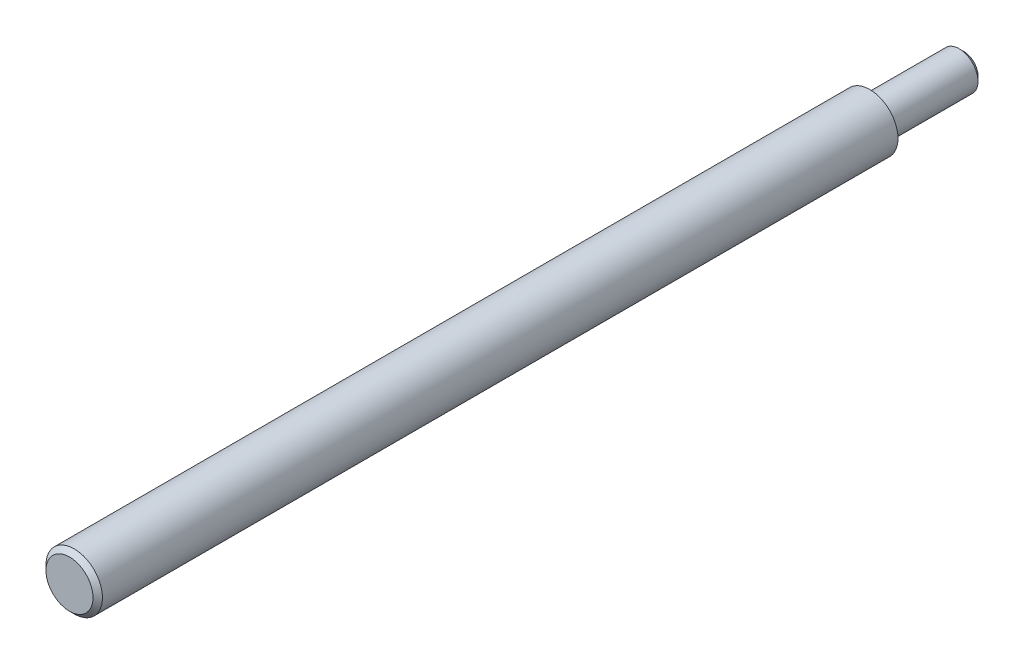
from build123d import *

# Parameters (mm, degrees)
SKETCH_1_R      = 6
EXTRUDE_1_DEPTH = 170
SKETCH_2_R      = 4
EXTRUDE_2_DEPTH = 20
CHAMFER_1_SIZE  = 1
CHAMFER_2_SIZE  = 1


with BuildPart() as part:
    # Sketch 1 → Extrude 1 (new body)
    with BuildSketch(Plane.XY):
        Circle(SKETCH_1_R)
    extrude(amount=EXTRUDE_1_DEPTH)

    # Sketch 2 → Extrude 2 (add)
    with BuildSketch(Plane(origin=(0, 0, 0), x_dir=(-1, 0, 0), z_dir=(0, 0, -1))):
        with Locations(Location((0, 0, 0), (0, 0, 180))):
            Circle(SKETCH_2_R)
    extrude(amount=EXTRUDE_2_DEPTH)

    # Chamfer 1
    chamfer_1_edges = [part.edges().sort_by_distance(p)[0] for p in [
        (-6, 0, 170),
    ]]
    chamfer(chamfer_1_edges, length=CHAMFER_1_SIZE)

    # Chamfer 2
    chamfer_2_edges = [part.edges().sort_by_distance(p)[0] for p in [
        (-4, 0, -20),
    ]]
    chamfer(chamfer_2_edges, length=CHAMFER_2_SIZE)


solid = part.part
